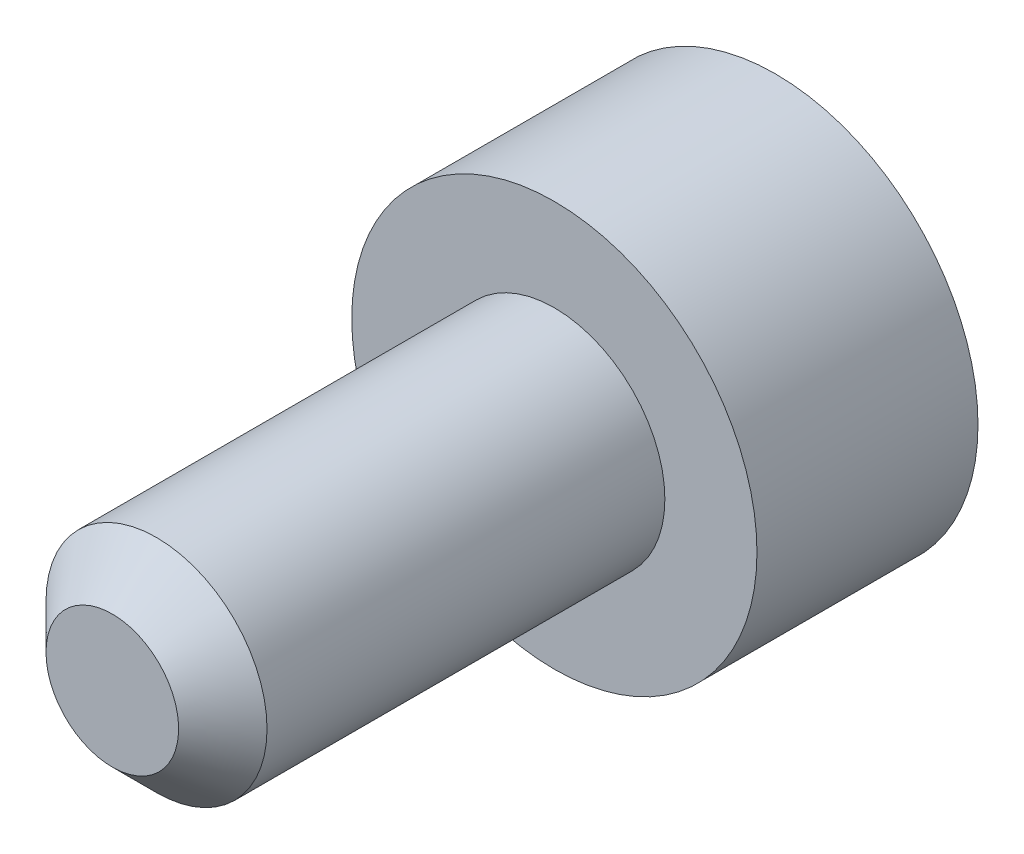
ISO-10303-21;
HEADER;
FILE_DESCRIPTION(('STEP AP214'),'2;1');
FILE_NAME('part.step','',(''),(''),'','','');
FILE_SCHEMA(('AUTOMOTIVE_DESIGN { 1 0 10303 214 1 1 1 1 }'));
ENDSEC;
DATA;
#1=APPLICATION_CONTEXT('core data for automotive mechanical design processes');
#2=APPLICATION_PROTOCOL_DEFINITION('international standard','automotive_design',2000,#1);
#3=PRODUCT_CONTEXT('',#1,'mechanical');
#4=PRODUCT('Part','Part','',(#3));
#5=PRODUCT_RELATED_PRODUCT_CATEGORY('part','',(#4));
#6=PRODUCT_DEFINITION_FORMATION('','',#4);
#7=PRODUCT_DEFINITION_CONTEXT('part definition',#1,'design');
#8=PRODUCT_DEFINITION('design','',#6,#7);
#9=PRODUCT_DEFINITION_SHAPE('','',#8);
#10=(LENGTH_UNIT() NAMED_UNIT(*) SI_UNIT(.MILLI.,.METRE.));
#11=(NAMED_UNIT(*) PLANE_ANGLE_UNIT() SI_UNIT($,.RADIAN.));
#12=(NAMED_UNIT(*) SI_UNIT($,.STERADIAN.) SOLID_ANGLE_UNIT());
#13=UNCERTAINTY_MEASURE_WITH_UNIT(LENGTH_MEASURE(1.E-05),#10,'distance_accuracy_value','');
#14=(GEOMETRIC_REPRESENTATION_CONTEXT(3) GLOBAL_UNCERTAINTY_ASSIGNED_CONTEXT((#13)) GLOBAL_UNIT_ASSIGNED_CONTEXT((#10,
#11,#12)) REPRESENTATION_CONTEXT('',''));
#15=CARTESIAN_POINT('',(0.,0.,0.));
#16=DIRECTION('',(0.,0.,1.));
#17=DIRECTION('',(1.,0.,0.));
#18=AXIS2_PLACEMENT_3D('',#15,#16,#17);
#19=CARTESIAN_POINT('',(14.,-1.44337567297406,2.5));
#20=DIRECTION('',(-0.5,0.86602540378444,0.));
#21=DIRECTION('',(0.86602540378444,0.5,0.));
#22=AXIS2_PLACEMENT_3D('',#19,#20,#21);
#23=PLANE('',#22);
#24=DIRECTION('',(0.,0.,-1.));
#25=VECTOR('',#24,1.);
#26=CARTESIAN_POINT('',(15.25,-0.721687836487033,2.5));
#27=LINE('',#26,#25);
#28=CARTESIAN_POINT('',(15.25,-0.721687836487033,2.5));
#29=VERTEX_POINT('',#28);
#30=CARTESIAN_POINT('',(15.25,-0.721687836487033,1.));
#31=VERTEX_POINT('',#30);
#32=EDGE_CURVE('E63',#29,#31,#27,.T.);
#33=ORIENTED_EDGE('',*,*,#32,.T.);
#34=DIRECTION('',(0.866025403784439,0.5,0.));
#35=VECTOR('',#34,1.);
#36=CARTESIAN_POINT('',(14.,-1.44337567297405,0.99999999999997));
#37=LINE('',#36,#35);
#38=CARTESIAN_POINT('',(14.,-1.44337567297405,0.99999999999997));
#39=VERTEX_POINT('',#38);
#40=EDGE_CURVE('E29',#39,#31,#37,.T.);
#41=ORIENTED_EDGE('',*,*,#40,.F.);
#42=DIRECTION('',(0.,0.,-1.));
#43=VECTOR('',#42,1.);
#44=CARTESIAN_POINT('',(14.,-1.44337567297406,2.5));
#45=LINE('',#44,#43);
#46=CARTESIAN_POINT('',(14.,-1.44337567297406,2.5));
#47=VERTEX_POINT('',#46);
#48=EDGE_CURVE('E33',#47,#39,#45,.T.);
#49=ORIENTED_EDGE('',*,*,#48,.F.);
#50=DIRECTION('',(0.866025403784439,0.5,0.));
#51=VECTOR('',#50,1.);
#52=CARTESIAN_POINT('',(14.,-1.44337567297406,2.5));
#53=LINE('',#52,#51);
#54=EDGE_CURVE('E65',#47,#29,#53,.T.);
#55=ORIENTED_EDGE('',*,*,#54,.T.);
#56=EDGE_LOOP('',(#33,#41,#49,#55));
#57=FACE_BOUND('',#56,.T.);
#58=ADVANCED_FACE('F14',(#57),#23,.T.);
#59=CARTESIAN_POINT('',(15.25,0.721687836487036,2.5));
#60=DIRECTION('',(1.,0.,0.));
#61=DIRECTION('',(0.,-1.,0.));
#62=AXIS2_PLACEMENT_3D('',#59,#60,#61);
#63=PLANE('',#62);
#64=DIRECTION('',(0.,0.,-1.));
#65=VECTOR('',#64,1.);
#66=CARTESIAN_POINT('',(15.25,0.721687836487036,2.5));
#67=LINE('',#66,#65);
#68=CARTESIAN_POINT('',(15.25,0.721687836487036,2.5));
#69=VERTEX_POINT('',#68);
#70=CARTESIAN_POINT('',(15.25,0.721687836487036,1.));
#71=VERTEX_POINT('',#70);
#72=EDGE_CURVE('E70',#69,#71,#67,.T.);
#73=ORIENTED_EDGE('',*,*,#72,.T.);
#74=DIRECTION('',(0.,-1.,0.));
#75=VECTOR('',#74,1.);
#76=CARTESIAN_POINT('',(15.25,0.721687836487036,1.));
#77=LINE('',#76,#75);
#78=EDGE_CURVE('E73',#71,#31,#77,.T.);
#79=ORIENTED_EDGE('',*,*,#78,.T.);
#80=ORIENTED_EDGE('',*,*,#32,.F.);
#81=DIRECTION('',(0.,-1.,0.));
#82=VECTOR('',#81,1.);
#83=CARTESIAN_POINT('',(15.25,0.721687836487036,2.5));
#84=LINE('',#83,#82);
#85=EDGE_CURVE('E100',#69,#29,#84,.T.);
#86=ORIENTED_EDGE('',*,*,#85,.F.);
#87=EDGE_LOOP('',(#73,#79,#80,#86));
#88=FACE_BOUND('',#87,.T.);
#89=ADVANCED_FACE('F74',(#88),#63,.F.);
#90=CARTESIAN_POINT('',(14.,1.44337567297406,2.5));
#91=DIRECTION('',(0.5,0.86602540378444,0.));
#92=DIRECTION('',(0.86602540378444,-0.5,0.));
#93=AXIS2_PLACEMENT_3D('',#90,#91,#92);
#94=PLANE('',#93);
#95=DIRECTION('',(0.,0.,-1.));
#96=VECTOR('',#95,1.);
#97=CARTESIAN_POINT('',(14.,1.44337567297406,2.5));
#98=LINE('',#97,#96);
#99=CARTESIAN_POINT('',(14.,1.44337567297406,2.5));
#100=VERTEX_POINT('',#99);
#101=CARTESIAN_POINT('',(14.,1.44337567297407,1.));
#102=VERTEX_POINT('',#101);
#103=EDGE_CURVE('E108',#100,#102,#98,.T.);
#104=ORIENTED_EDGE('',*,*,#103,.T.);
#105=DIRECTION('',(0.86602540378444,-0.5,0.));
#106=VECTOR('',#105,1.);
#107=CARTESIAN_POINT('',(14.,1.44337567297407,1.));
#108=LINE('',#107,#106);
#109=EDGE_CURVE('E78',#102,#71,#108,.T.);
#110=ORIENTED_EDGE('',*,*,#109,.T.);
#111=ORIENTED_EDGE('',*,*,#72,.F.);
#112=DIRECTION('',(0.86602540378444,-0.5,0.));
#113=VECTOR('',#112,1.);
#114=CARTESIAN_POINT('',(14.,1.44337567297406,2.5));
#115=LINE('',#114,#113);
#116=EDGE_CURVE('E97',#100,#69,#115,.T.);
#117=ORIENTED_EDGE('',*,*,#116,.F.);
#118=EDGE_LOOP('',(#104,#110,#111,#117));
#119=FACE_BOUND('',#118,.T.);
#120=ADVANCED_FACE('F139',(#119),#94,.F.);
#121=CARTESIAN_POINT('',(14.,1.44337567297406,2.5));
#122=DIRECTION('',(0.5,-0.86602540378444,0.));
#123=DIRECTION('',(-0.86602540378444,-0.5,0.));
#124=AXIS2_PLACEMENT_3D('',#121,#122,#123);
#125=PLANE('',#124);
#126=DIRECTION('',(0.,0.,-1.));
#127=VECTOR('',#126,1.);
#128=CARTESIAN_POINT('',(12.75,0.721687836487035,2.5));
#129=LINE('',#128,#127);
#130=CARTESIAN_POINT('',(12.75,0.721687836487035,2.5));
#131=VERTEX_POINT('',#130);
#132=CARTESIAN_POINT('',(12.75,0.721687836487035,1.));
#133=VERTEX_POINT('',#132);
#134=EDGE_CURVE('E106',#131,#133,#129,.T.);
#135=ORIENTED_EDGE('',*,*,#134,.T.);
#136=DIRECTION('',(-0.86602540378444,-0.5,0.));
#137=VECTOR('',#136,1.);
#138=CARTESIAN_POINT('',(14.,1.44337567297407,1.));
#139=LINE('',#138,#137);
#140=EDGE_CURVE('E185',#102,#133,#139,.T.);
#141=ORIENTED_EDGE('',*,*,#140,.F.);
#142=ORIENTED_EDGE('',*,*,#103,.F.);
#143=DIRECTION('',(-0.86602540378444,-0.5,0.));
#144=VECTOR('',#143,1.);
#145=CARTESIAN_POINT('',(14.,1.44337567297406,2.5));
#146=LINE('',#145,#144);
#147=EDGE_CURVE('E94',#100,#131,#146,.T.);
#148=ORIENTED_EDGE('',*,*,#147,.T.);
#149=EDGE_LOOP('',(#135,#141,#142,#148));
#150=FACE_BOUND('',#149,.T.);
#151=ADVANCED_FACE('F151',(#150),#125,.T.);
#152=CARTESIAN_POINT('',(12.75,-0.721687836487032,2.5));
#153=DIRECTION('',(-1.,0.,0.));
#154=DIRECTION('',(0.,1.,0.));
#155=AXIS2_PLACEMENT_3D('',#152,#153,#154);
#156=PLANE('',#155);
#157=DIRECTION('',(0.,0.,-1.));
#158=VECTOR('',#157,1.);
#159=CARTESIAN_POINT('',(12.75,-0.721687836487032,2.5));
#160=LINE('',#159,#158);
#161=CARTESIAN_POINT('',(12.75,-0.721687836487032,2.5));
#162=VERTEX_POINT('',#161);
#163=CARTESIAN_POINT('',(12.75,-0.721687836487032,1.));
#164=VERTEX_POINT('',#163);
#165=EDGE_CURVE('E104',#162,#164,#160,.T.);
#166=ORIENTED_EDGE('',*,*,#165,.T.);
#167=DIRECTION('',(0.,1.,0.));
#168=VECTOR('',#167,1.);
#169=CARTESIAN_POINT('',(12.75,-0.721687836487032,1.));
#170=LINE('',#169,#168);
#171=EDGE_CURVE('E186',#164,#133,#170,.T.);
#172=ORIENTED_EDGE('',*,*,#171,.T.);
#173=ORIENTED_EDGE('',*,*,#134,.F.);
#174=DIRECTION('',(0.,1.,0.));
#175=VECTOR('',#174,1.);
#176=CARTESIAN_POINT('',(12.75,-0.721687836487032,2.5));
#177=LINE('',#176,#175);
#178=EDGE_CURVE('E91',#162,#131,#177,.T.);
#179=ORIENTED_EDGE('',*,*,#178,.F.);
#180=EDGE_LOOP('',(#166,#172,#173,#179));
#181=FACE_BOUND('',#180,.T.);
#182=ADVANCED_FACE('F147',(#181),#156,.F.);
#183=CARTESIAN_POINT('',(14.,-1.44337567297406,2.5));
#184=DIRECTION('',(-0.5,-0.86602540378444,0.));
#185=DIRECTION('',(-0.86602540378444,0.5,0.));
#186=AXIS2_PLACEMENT_3D('',#183,#184,#185);
#187=PLANE('',#186);
#188=DIRECTION('',(-0.86602540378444,0.5,0.));
#189=VECTOR('',#188,1.);
#190=CARTESIAN_POINT('',(14.,-1.44337567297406,2.5));
#191=LINE('',#190,#189);
#192=EDGE_CURVE('E88',#47,#162,#191,.T.);
#193=ORIENTED_EDGE('',*,*,#192,.F.);
#194=ORIENTED_EDGE('',*,*,#48,.T.);
#195=DIRECTION('',(-0.86602540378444,0.5,0.));
#196=VECTOR('',#195,1.);
#197=CARTESIAN_POINT('',(14.,-1.44337567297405,0.99999999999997));
#198=LINE('',#197,#196);
#199=EDGE_CURVE('E84',#39,#164,#198,.T.);
#200=ORIENTED_EDGE('',*,*,#199,.T.);
#201=ORIENTED_EDGE('',*,*,#165,.F.);
#202=EDGE_LOOP('',(#193,#194,#200,#201));
#203=FACE_BOUND('',#202,.T.);
#204=ADVANCED_FACE('F144',(#203),#187,.F.);
#205=CARTESIAN_POINT('',(15.25,-0.721687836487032,2.5));
#206=DIRECTION('',(0.,0.,-1.));
#207=DIRECTION('',(1.,0.,0.));
#208=AXIS2_PLACEMENT_3D('',#205,#206,#207);
#209=PLANE('',#208);
#210=ORIENTED_EDGE('',*,*,#54,.F.);
#211=ORIENTED_EDGE('',*,*,#192,.T.);
#212=ORIENTED_EDGE('',*,*,#178,.T.);
#213=ORIENTED_EDGE('',*,*,#147,.F.);
#214=ORIENTED_EDGE('',*,*,#116,.T.);
#215=ORIENTED_EDGE('',*,*,#85,.T.);
#216=EDGE_LOOP('',(#210,#211,#212,#213,#214,#215));
#217=FACE_BOUND('',#216,.T.);
#218=ADVANCED_FACE('F143',(#217),#209,.T.);
#219=CARTESIAN_POINT('',(14.,0.,1.));
#220=DIRECTION('',(0.,0.,-1.));
#221=DIRECTION('',(1.,0.,0.));
#222=AXIS2_PLACEMENT_3D('',#219,#220,#221);
#223=PLANE('',#222);
#224=CARTESIAN_POINT('',(14.,0.,1.));
#225=DIRECTION('',(0.,0.,-1.));
#226=DIRECTION('',(1.,0.,0.));
#227=AXIS2_PLACEMENT_3D('',#224,#225,#226);
#228=CIRCLE('',#227,2.75);
#229=CARTESIAN_POINT('',(16.75,0.,1.));
#230=VERTEX_POINT('',#229);
#231=EDGE_CURVE('E116',#230,#230,#228,.T.);
#232=ORIENTED_EDGE('',*,*,#231,.T.);
#233=EDGE_LOOP('',(#232));
#234=FACE_BOUND('',#233,.T.);
#235=ORIENTED_EDGE('',*,*,#199,.F.);
#236=ORIENTED_EDGE('',*,*,#40,.T.);
#237=ORIENTED_EDGE('',*,*,#78,.F.);
#238=ORIENTED_EDGE('',*,*,#109,.F.);
#239=ORIENTED_EDGE('',*,*,#140,.T.);
#240=ORIENTED_EDGE('',*,*,#171,.F.);
#241=EDGE_LOOP('',(#235,#236,#237,#238,#239,#240));
#242=FACE_BOUND('',#241,.T.);
#243=ADVANCED_FACE('F81',(#234,#242),#223,.T.);
#244=CARTESIAN_POINT('',(14.,0.,-10.));
#245=DIRECTION('',(0.,0.,-1.));
#246=DIRECTION('',(1.,0.,0.));
#247=AXIS2_PLACEMENT_3D('',#244,#245,#246);
#248=CYLINDRICAL_SURFACE('',#247,2.75);
#249=CARTESIAN_POINT('',(14.,0.,4.));
#250=DIRECTION('',(0.,0.,-1.));
#251=DIRECTION('',(1.,0.,0.));
#252=AXIS2_PLACEMENT_3D('',#249,#250,#251);
#253=CIRCLE('',#252,2.75);
#254=CARTESIAN_POINT('',(16.75,0.,4.));
#255=VERTEX_POINT('',#254);
#256=EDGE_CURVE('E113',#255,#255,#253,.T.);
#257=ORIENTED_EDGE('',*,*,#256,.T.);
#258=EDGE_LOOP('',(#257));
#259=FACE_BOUND('',#258,.T.);
#260=ORIENTED_EDGE('',*,*,#231,.F.);
#261=EDGE_LOOP('',(#260));
#262=FACE_BOUND('',#261,.T.);
#263=ADVANCED_FACE('F164',(#259,#262),#248,.T.);
#264=CARTESIAN_POINT('',(16.75,0.,4.));
#265=DIRECTION('',(0.,0.,1.));
#266=DIRECTION('',(-1.,0.,0.));
#267=AXIS2_PLACEMENT_3D('',#264,#265,#266);
#268=PLANE('',#267);
#269=CARTESIAN_POINT('',(14.,0.,4.));
#270=DIRECTION('',(0.,0.,-1.));
#271=DIRECTION('',(1.,0.,0.));
#272=AXIS2_PLACEMENT_3D('',#269,#270,#271);
#273=CIRCLE('',#272,1.5);
#274=CARTESIAN_POINT('',(15.5,0.,4.));
#275=VERTEX_POINT('',#274);
#276=EDGE_CURVE('E69',#275,#275,#273,.T.);
#277=ORIENTED_EDGE('',*,*,#276,.T.);
#278=EDGE_LOOP('',(#277));
#279=FACE_BOUND('',#278,.T.);
#280=ORIENTED_EDGE('',*,*,#256,.F.);
#281=EDGE_LOOP('',(#280));
#282=FACE_BOUND('',#281,.T.);
#283=ADVANCED_FACE('F161',(#279,#282),#268,.T.);
#284=CARTESIAN_POINT('',(14.,0.,-10.));
#285=DIRECTION('',(0.,0.,-1.));
#286=DIRECTION('',(1.,0.,0.));
#287=AXIS2_PLACEMENT_3D('',#284,#285,#286);
#288=CYLINDRICAL_SURFACE('',#287,1.5);
#289=CARTESIAN_POINT('',(14.,0.,9.4));
#290=DIRECTION('',(0.,0.,1.));
#291=DIRECTION('',(-1.,0.,0.));
#292=AXIS2_PLACEMENT_3D('',#289,#290,#291);
#293=CIRCLE('',#292,1.5);
#294=CARTESIAN_POINT('',(12.5,0.,9.4));
#295=VERTEX_POINT('',#294);
#296=EDGE_CURVE('E22',#295,#295,#293,.F.);
#297=ORIENTED_EDGE('',*,*,#296,.T.);
#298=EDGE_LOOP('',(#297));
#299=FACE_BOUND('',#298,.T.);
#300=ORIENTED_EDGE('',*,*,#276,.F.);
#301=EDGE_LOOP('',(#300));
#302=FACE_BOUND('',#301,.T.);
#303=ADVANCED_FACE('F121',(#299,#302),#288,.T.);
#304=CARTESIAN_POINT('',(15.5,0.,10.));
#305=DIRECTION('',(0.,0.,1.));
#306=DIRECTION('',(-1.,0.,0.));
#307=AXIS2_PLACEMENT_3D('',#304,#305,#306);
#308=PLANE('',#307);
#309=CARTESIAN_POINT('',(14.,0.,10.));
#310=DIRECTION('',(0.,0.,1.));
#311=DIRECTION('',(-1.,0.,0.));
#312=AXIS2_PLACEMENT_3D('',#309,#310,#311);
#313=CIRCLE('',#312,0.9);
#314=CARTESIAN_POINT('',(13.1,0.,10.));
#315=VERTEX_POINT('',#314);
#316=EDGE_CURVE('E9',#315,#315,#313,.T.);
#317=ORIENTED_EDGE('',*,*,#316,.T.);
#318=EDGE_LOOP('',(#317));
#319=FACE_BOUND('',#318,.T.);
#320=ADVANCED_FACE('F125',(#319),#308,.T.);
#321=CARTESIAN_POINT('',(14.,0.,9.4));
#322=DIRECTION('',(0.,0.,-1.));
#323=DIRECTION('',(1.,0.,0.));
#324=AXIS2_PLACEMENT_3D('',#321,#322,#323);
#325=CONICAL_SURFACE('',#324,1.5,0.785398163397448);
#326=ORIENTED_EDGE('',*,*,#316,.F.);
#327=EDGE_LOOP('',(#326));
#328=FACE_BOUND('',#327,.T.);
#329=ORIENTED_EDGE('',*,*,#296,.F.);
#330=EDGE_LOOP('',(#329));
#331=FACE_BOUND('',#330,.T.);
#332=ADVANCED_FACE('F16',(#328,#331),#325,.T.);
#333=CLOSED_SHELL('',(#58,#89,#120,#151,#182,#204,#218,#243,#263,#283,#303,#320,#332));
#334=MANIFOLD_SOLID_BREP('B1',#333);
#335=ADVANCED_BREP_SHAPE_REPRESENTATION('',(#18,#334),#14);
#336=SHAPE_DEFINITION_REPRESENTATION(#9,#335);
ENDSEC;
END-ISO-10303-21;
